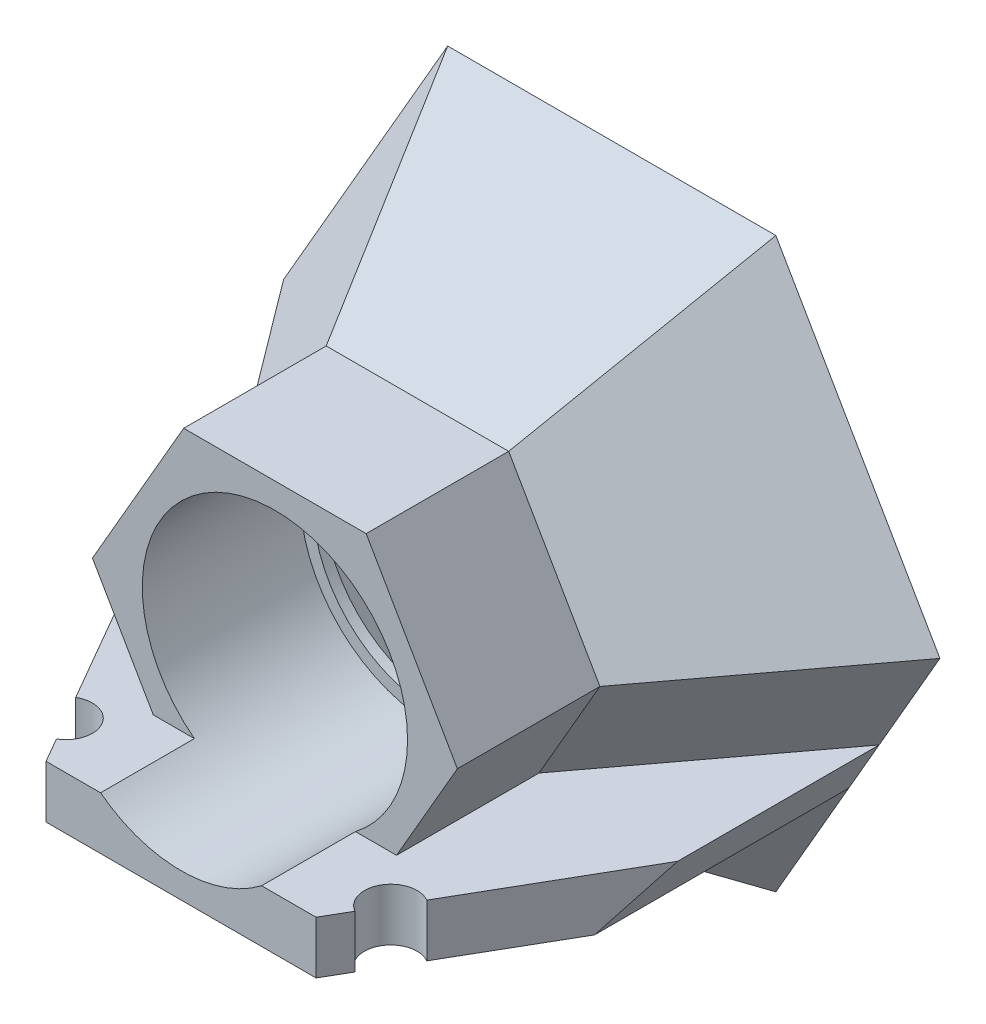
ISO-10303-21;
HEADER;
FILE_DESCRIPTION(('STEP AP214'),'2;1');
FILE_NAME('part.step','',(''),(''),'','','');
FILE_SCHEMA(('AUTOMOTIVE_DESIGN { 1 0 10303 214 1 1 1 1 }'));
ENDSEC;
DATA;
#1=APPLICATION_CONTEXT('core data for automotive mechanical design processes');
#2=APPLICATION_PROTOCOL_DEFINITION('international standard','automotive_design',2000,#1);
#3=PRODUCT_CONTEXT('',#1,'mechanical');
#4=PRODUCT('Part','Part','',(#3));
#5=PRODUCT_RELATED_PRODUCT_CATEGORY('part','',(#4));
#6=PRODUCT_DEFINITION_FORMATION('','',#4);
#7=PRODUCT_DEFINITION_CONTEXT('part definition',#1,'design');
#8=PRODUCT_DEFINITION('design','',#6,#7);
#9=PRODUCT_DEFINITION_SHAPE('','',#8);
#10=(LENGTH_UNIT() NAMED_UNIT(*) SI_UNIT(.MILLI.,.METRE.));
#11=(NAMED_UNIT(*) PLANE_ANGLE_UNIT() SI_UNIT($,.RADIAN.));
#12=(NAMED_UNIT(*) SI_UNIT($,.STERADIAN.) SOLID_ANGLE_UNIT());
#13=UNCERTAINTY_MEASURE_WITH_UNIT(LENGTH_MEASURE(1.E-05),#10,'distance_accuracy_value','');
#14=(GEOMETRIC_REPRESENTATION_CONTEXT(3) GLOBAL_UNCERTAINTY_ASSIGNED_CONTEXT((#13)) GLOBAL_UNIT_ASSIGNED_CONTEXT((#10,
#11,#12)) REPRESENTATION_CONTEXT('',''));
#15=CARTESIAN_POINT('',(0.,0.,0.));
#16=DIRECTION('',(0.,0.,1.));
#17=DIRECTION('',(1.,0.,0.));
#18=AXIS2_PLACEMENT_3D('',#15,#16,#17);
#19=CARTESIAN_POINT('',(-12.6982856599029,-15.0059240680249,9.57143399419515));
#20=DIRECTION('',(0.866025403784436,0.,-0.500000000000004));
#21=DIRECTION('',(-0.500000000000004,0.,-0.866025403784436));
#22=AXIS2_PLACEMENT_3D('',#19,#20,#21);
#23=PLANE('',#22);
#24=DIRECTION('',(-0.500000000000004,0.,-0.866025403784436));
#25=VECTOR('',#24,1.);
#26=CARTESIAN_POINT('',(-12.6982856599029,-5.00592406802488,9.57143399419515));
#27=LINE('',#26,#25);
#28=CARTESIAN_POINT('',(-8.33733836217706,-5.00592406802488,17.1248162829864));
#29=VERTEX_POINT('',#28);
#30=CARTESIAN_POINT('',(-12.6982856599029,-5.00592406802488,9.57143399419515));
#31=VERTEX_POINT('',#30);
#32=EDGE_CURVE('E488',#29,#31,#27,.T.);
#33=ORIENTED_EDGE('',*,*,#32,.T.);
#34=DIRECTION('',(0.377964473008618,-0.654653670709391,0.654653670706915));
#35=VECTOR('',#34,1.);
#36=CARTESIAN_POINT('',(-10.2239273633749,-9.29163835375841,13.8571482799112));
#37=LINE('',#36,#35);
#38=CARTESIAN_POINT('',(-11.254909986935,-7.50592406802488,12.0714339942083));
#39=VERTEX_POINT('',#38);
#40=EDGE_CURVE('E270',#31,#39,#37,.T.);
#41=ORIENTED_EDGE('',*,*,#40,.T.);
#42=DIRECTION('',(0.500000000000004,0.,0.866025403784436));
#43=VECTOR('',#42,1.);
#44=CARTESIAN_POINT('',(-216521.102599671,-7.50592406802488,-374993.985103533));
#45=LINE('',#44,#43);
#46=CARTESIAN_POINT('',(-8.33733836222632,-7.50592406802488,17.1248162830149));
#47=VERTEX_POINT('',#46);
#48=EDGE_CURVE('E487',#39,#47,#45,.T.);
#49=ORIENTED_EDGE('',*,*,#48,.T.);
#50=DIRECTION('',(0.,1.,0.));
#51=VECTOR('',#50,1.);
#52=CARTESIAN_POINT('',(-8.33733836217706,-15.0059240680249,17.1248162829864));
#53=LINE('',#52,#51);
#54=EDGE_CURVE('E12',#47,#29,#53,.T.);
#55=ORIENTED_EDGE('',*,*,#54,.T.);
#56=EDGE_LOOP('',(#33,#41,#49,#55));
#57=FACE_BOUND('',#56,.T.);
#58=ADVANCED_FACE('F47',(#57),#23,.F.);
#59=CARTESIAN_POINT('',(12.6982856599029,-15.0059240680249,9.57143399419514));
#60=DIRECTION('',(-0.866025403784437,0.,-0.500000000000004));
#61=DIRECTION('',(-0.500000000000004,0.,0.866025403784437));
#62=AXIS2_PLACEMENT_3D('',#59,#60,#61);
#63=PLANE('',#62);
#64=DIRECTION('',(0.500000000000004,0.,-0.866025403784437));
#65=VECTOR('',#64,1.);
#66=CARTESIAN_POINT('',(216518.93582603,-7.50592406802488,-374990.2321415));
#67=LINE('',#66,#65);
#68=CARTESIAN_POINT('',(6.41330025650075,-7.50592406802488,20.4573480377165));
#69=VERTEX_POINT('',#68);
#70=CARTESIAN_POINT('',(7.08733836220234,-7.50592406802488,19.2898797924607));
#71=VERTEX_POINT('',#70);
#72=EDGE_CURVE('E274',#69,#71,#67,.T.);
#73=ORIENTED_EDGE('',*,*,#72,.T.);
#74=DIRECTION('',(0.,1.,0.));
#75=VECTOR('',#74,1.);
#76=CARTESIAN_POINT('',(7.08733836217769,-15.0059240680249,19.2898797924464));
#77=LINE('',#76,#75);
#78=CARTESIAN_POINT('',(7.08733836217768,-5.00592406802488,19.2898797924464));
#79=VERTEX_POINT('',#78);
#80=EDGE_CURVE('E472',#71,#79,#77,.T.);
#81=ORIENTED_EDGE('',*,*,#80,.T.);
#82=DIRECTION('',(-0.500000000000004,0.,0.866025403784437));
#83=VECTOR('',#82,1.);
#84=CARTESIAN_POINT('',(12.6982856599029,-5.00592406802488,9.57143399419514));
#85=LINE('',#84,#83);
#86=CARTESIAN_POINT('',(6.41330025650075,-5.00592406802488,20.4573480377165));
#87=VERTEX_POINT('',#86);
#88=EDGE_CURVE('E279',#79,#87,#85,.T.);
#89=ORIENTED_EDGE('',*,*,#88,.T.);
#90=DIRECTION('',(0.,1.,0.));
#91=VECTOR('',#90,1.);
#92=CARTESIAN_POINT('',(6.41330025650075,-15.0059240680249,20.4573480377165));
#93=LINE('',#92,#91);
#94=EDGE_CURVE('E495',#69,#87,#93,.T.);
#95=ORIENTED_EDGE('',*,*,#94,.F.);
#96=EDGE_LOOP('',(#73,#81,#89,#95));
#97=FACE_BOUND('',#96,.T.);
#98=ADVANCED_FACE('F550',(#97),#63,.F.);
#99=CARTESIAN_POINT('',(11.2549099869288,-7.50592406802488,-500000.));
#100=DIRECTION('',(0.866025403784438,-0.500000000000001,0.));
#101=DIRECTION('',(0.500000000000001,0.866025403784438,0.));
#102=AXIS2_PLACEMENT_3D('',#99,#100,#101);
#103=PLANE('',#102);
#104=DIRECTION('',(0.,0.,1.));
#105=VECTOR('',#104,1.);
#106=CARTESIAN_POINT('',(12.6982856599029,-5.00592406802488,-500000.));
#107=LINE('',#106,#105);
#108=CARTESIAN_POINT('',(12.6982856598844,-5.00592406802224,1.70530256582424E-10));
#109=VERTEX_POINT('',#108);
#110=CARTESIAN_POINT('',(12.6982856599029,-5.00592406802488,9.57143399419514));
#111=VERTEX_POINT('',#110);
#112=EDGE_CURVE('E261',#109,#111,#107,.T.);
#113=ORIENTED_EDGE('',*,*,#112,.T.);
#114=DIRECTION('',(0.377964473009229,0.65465367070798,-0.654653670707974));
#115=VECTOR('',#114,1.);
#116=CARTESIAN_POINT('',(10.2239273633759,-9.2916383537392,13.8571482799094));
#117=LINE('',#116,#115);
#118=CARTESIAN_POINT('',(11.2549099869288,-7.50592406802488,12.0714339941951));
#119=VERTEX_POINT('',#118);
#120=EDGE_CURVE('E264',#119,#111,#117,.T.);
#121=ORIENTED_EDGE('',*,*,#120,.F.);
#122=DIRECTION('',(0.,0.,1.));
#123=VECTOR('',#122,1.);
#124=CARTESIAN_POINT('',(11.2549099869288,-7.50592406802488,-500000.));
#125=LINE('',#124,#123);
#126=CARTESIAN_POINT('',(11.2549099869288,-7.50592406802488,5.6843418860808E-11));
#127=VERTEX_POINT('',#126);
#128=EDGE_CURVE('E251',#127,#119,#125,.T.);
#129=ORIENTED_EDGE('',*,*,#128,.F.);
#130=DIRECTION('',(-0.500000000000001,-0.866025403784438,0.));
#131=VECTOR('',#130,1.);
#132=CARTESIAN_POINT('',(11.2549099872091,-7.50592406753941,5.6843418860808E-11));
#133=LINE('',#132,#131);
#134=EDGE_CURVE('E308',#127,#109,#133,.F.);
#135=ORIENTED_EDGE('',*,*,#134,.T.);
#136=EDGE_LOOP('',(#113,#121,#129,#135));
#137=FACE_BOUND('',#136,.T.);
#138=ADVANCED_FACE('F265',(#137),#103,.T.);
#139=CARTESIAN_POINT('',(-11.2549099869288,-7.50592406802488,-500000.));
#140=DIRECTION('',(-0.866025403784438,-0.500000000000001,0.));
#141=DIRECTION('',(0.500000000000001,-0.866025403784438,0.));
#142=AXIS2_PLACEMENT_3D('',#139,#140,#141);
#143=PLANE('',#142);
#144=DIRECTION('',(0.,0.,1.));
#145=VECTOR('',#144,1.);
#146=CARTESIAN_POINT('',(-11.2549099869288,-7.50592406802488,-500000.));
#147=LINE('',#146,#145);
#148=CARTESIAN_POINT('',(-11.2549099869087,-7.50592406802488,5.6843418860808E-11));
#149=VERTEX_POINT('',#148);
#150=EDGE_CURVE('E301',#149,#39,#147,.T.);
#151=ORIENTED_EDGE('',*,*,#150,.T.);
#152=ORIENTED_EDGE('',*,*,#40,.F.);
#153=DIRECTION('',(0.,0.,1.));
#154=VECTOR('',#153,1.);
#155=CARTESIAN_POINT('',(-12.6982856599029,-5.00592406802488,-500000.));
#156=LINE('',#155,#154);
#157=CARTESIAN_POINT('',(-12.6982856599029,-5.00592406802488,5.6843418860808E-11));
#158=VERTEX_POINT('',#157);
#159=EDGE_CURVE('E296',#158,#31,#156,.T.);
#160=ORIENTED_EDGE('',*,*,#159,.F.);
#161=DIRECTION('',(-0.500000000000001,0.866025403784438,0.));
#162=VECTOR('',#161,1.);
#163=CARTESIAN_POINT('',(-11.2549099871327,-7.50592406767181,5.6843418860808E-11));
#164=LINE('',#163,#162);
#165=EDGE_CURVE('E295',#158,#149,#164,.F.);
#166=ORIENTED_EDGE('',*,*,#165,.T.);
#167=EDGE_LOOP('',(#151,#152,#160,#166));
#168=FACE_BOUND('',#167,.T.);
#169=ADVANCED_FACE('F578',(#168),#143,.T.);
#170=CARTESIAN_POINT('',(-15.5884572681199,0.,0.));
#171=DIRECTION('',(-0.72631001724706,-0.419335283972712,0.544639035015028));
#172=DIRECTION('',(0.599934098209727,0.,0.800049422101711));
#173=AXIS2_PLACEMENT_3D('',#170,#171,#172);
#174=PLANE('',#173);
#175=DIRECTION('',(-0.299967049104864,-0.519558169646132,-0.800049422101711));
#176=VECTOR('',#175,1.);
#177=CARTESIAN_POINT('',(-7.79422863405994,-13.5,0.));
#178=LINE('',#177,#176);
#179=CARTESIAN_POINT('',(-4.33354728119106,-7.50592406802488,9.23006751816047));
#180=VERTEX_POINT('',#179);
#181=CARTESIAN_POINT('',(-7.79422863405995,-13.5,0.));
#182=VERTEX_POINT('',#181);
#183=EDGE_CURVE('E437',#180,#182,#178,.T.);
#184=ORIENTED_EDGE('',*,*,#183,.F.);
#185=DIRECTION('',(-0.599934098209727,0.,-0.800049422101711));
#186=VECTOR('',#185,1.);
#187=CARTESIAN_POINT('',(-239997.228052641,-7.50592406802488,-320036.216808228));
#188=LINE('',#187,#186);
#189=EDGE_CURVE('E293',#149,#180,#188,.F.);
#190=ORIENTED_EDGE('',*,*,#189,.F.);
#191=DIRECTION('',(0.5,-0.866025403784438,0.));
#192=VECTOR('',#191,1.);
#193=CARTESIAN_POINT('',(-15.5884572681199,0.,0.));
#194=LINE('',#193,#192);
#195=EDGE_CURVE('E417',#149,#182,#194,.T.);
#196=ORIENTED_EDGE('',*,*,#195,.T.);
#197=EDGE_LOOP('',(#184,#190,#196));
#198=FACE_BOUND('',#197,.T.);
#199=ADVANCED_FACE('F520',(#198),#174,.T.);
#200=CARTESIAN_POINT('',(7.79422863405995,-13.5,0.));
#201=DIRECTION('',(0.72631001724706,-0.419335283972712,0.544639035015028));
#202=DIRECTION('',(0.599934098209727,0.,-0.800049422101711));
#203=AXIS2_PLACEMENT_3D('',#200,#201,#202);
#204=PLANE('',#203);
#205=DIRECTION('',(-0.5,-0.866025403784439,0.));
#206=VECTOR('',#205,1.);
#207=CARTESIAN_POINT('',(4.33354728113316,-7.50592406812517,9.23006751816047));
#208=LINE('',#207,#206);
#209=CARTESIAN_POINT('',(5.77692295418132,-5.00592406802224,9.23006751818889));
#210=VERTEX_POINT('',#209);
#211=CARTESIAN_POINT('',(8.66709456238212,0.,9.23006751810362));
#212=VERTEX_POINT('',#211);
#213=EDGE_CURVE('E347',#210,#212,#208,.F.);
#214=ORIENTED_EDGE('',*,*,#213,.F.);
#215=DIRECTION('',(0.599934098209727,0.,-0.800049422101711));
#216=VECTOR('',#215,1.);
#217=CARTESIAN_POINT('',(240001.162571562,-5.0059240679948,-320039.538902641));
#218=LINE('',#217,#216);
#219=EDGE_CURVE('E260',#109,#210,#218,.F.);
#220=ORIENTED_EDGE('',*,*,#219,.F.);
#221=DIRECTION('',(0.5,0.866025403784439,0.));
#222=VECTOR('',#221,1.);
#223=CARTESIAN_POINT('',(7.79422863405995,-13.5,0.));
#224=LINE('',#223,#222);
#225=CARTESIAN_POINT('',(15.5884572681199,0.,0.));
#226=VERTEX_POINT('',#225);
#227=EDGE_CURVE('E424',#109,#226,#224,.T.);
#228=ORIENTED_EDGE('',*,*,#227,.T.);
#229=DIRECTION('',(0.599934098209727,0.,-0.800049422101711));
#230=VECTOR('',#229,1.);
#231=CARTESIAN_POINT('',(15.5884572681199,0.,0.));
#232=LINE('',#231,#230);
#233=EDGE_CURVE('E428',#212,#226,#232,.T.);
#234=ORIENTED_EDGE('',*,*,#233,.F.);
#235=EDGE_LOOP('',(#214,#220,#228,#234));
#236=FACE_BOUND('',#235,.T.);
#237=ADVANCED_FACE('F535',(#236),#204,.T.);
#238=CARTESIAN_POINT('',(15.5884572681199,0.,0.));
#239=DIRECTION('',(0.72631001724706,0.419335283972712,0.544639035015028));
#240=DIRECTION('',(0.599934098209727,0.,-0.800049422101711));
#241=AXIS2_PLACEMENT_3D('',#238,#239,#240);
#242=PLANE('',#241);
#243=DIRECTION('',(0.299967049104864,0.519558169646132,-0.800049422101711));
#244=VECTOR('',#243,1.);
#245=CARTESIAN_POINT('',(7.79422863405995,13.5,0.));
#246=LINE('',#245,#244);
#247=CARTESIAN_POINT('',(4.33354728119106,7.50592406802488,9.23006751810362));
#248=VERTEX_POINT('',#247);
#249=CARTESIAN_POINT('',(7.79422863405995,13.5,0.));
#250=VERTEX_POINT('',#249);
#251=EDGE_CURVE('E429',#248,#250,#246,.T.);
#252=ORIENTED_EDGE('',*,*,#251,.F.);
#253=DIRECTION('',(0.5,-0.866025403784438,0.));
#254=VECTOR('',#253,1.);
#255=CARTESIAN_POINT('',(8.66709456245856,-1.32398094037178E-10,9.23006751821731));
#256=LINE('',#255,#254);
#257=EDGE_CURVE('E350',#212,#248,#256,.F.);
#258=ORIENTED_EDGE('',*,*,#257,.F.);
#259=ORIENTED_EDGE('',*,*,#233,.T.);
#260=DIRECTION('',(-0.5,0.866025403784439,0.));
#261=VECTOR('',#260,1.);
#262=CARTESIAN_POINT('',(15.5884572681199,0.,0.));
#263=LINE('',#262,#261);
#264=EDGE_CURVE('E381',#226,#250,#263,.T.);
#265=ORIENTED_EDGE('',*,*,#264,.T.);
#266=EDGE_LOOP('',(#252,#258,#259,#265));
#267=FACE_BOUND('',#266,.T.);
#268=ADVANCED_FACE('F547',(#267),#242,.T.);
#269=CARTESIAN_POINT('',(7.79422863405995,13.5,0.));
#270=DIRECTION('',(0.,0.838670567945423,0.544639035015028));
#271=DIRECTION('',(0.,-0.544639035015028,0.838670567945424));
#272=AXIS2_PLACEMENT_3D('',#269,#270,#271);
#273=PLANE('',#272);
#274=DIRECTION('',(-0.299967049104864,0.519558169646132,-0.800049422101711));
#275=VECTOR('',#274,1.);
#276=CARTESIAN_POINT('',(-7.79422863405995,13.5,0.));
#277=LINE('',#276,#275);
#278=CARTESIAN_POINT('',(-4.33354728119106,7.50592406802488,9.23006751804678));
#279=VERTEX_POINT('',#278);
#280=CARTESIAN_POINT('',(-7.79422863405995,13.5,0.));
#281=VERTEX_POINT('',#280);
#282=EDGE_CURVE('E432',#279,#281,#277,.T.);
#283=ORIENTED_EDGE('',*,*,#282,.F.);
#284=DIRECTION('',(1.,0.,0.));
#285=VECTOR('',#284,1.);
#286=CARTESIAN_POINT('',(4.33354728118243,7.50592406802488,9.23006751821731));
#287=LINE('',#286,#285);
#288=EDGE_CURVE('E359',#248,#279,#287,.F.);
#289=ORIENTED_EDGE('',*,*,#288,.F.);
#290=ORIENTED_EDGE('',*,*,#251,.T.);
#291=DIRECTION('',(-1.,0.,0.));
#292=VECTOR('',#291,1.);
#293=CARTESIAN_POINT('',(7.79422863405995,13.5,0.));
#294=LINE('',#293,#292);
#295=EDGE_CURVE('E411',#250,#281,#294,.T.);
#296=ORIENTED_EDGE('',*,*,#295,.T.);
#297=EDGE_LOOP('',(#283,#289,#290,#296));
#298=FACE_BOUND('',#297,.T.);
#299=ADVANCED_FACE('F49',(#298),#273,.T.);
#300=CARTESIAN_POINT('',(-7.79422863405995,13.5,0.));
#301=DIRECTION('',(-0.72631001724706,0.419335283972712,0.544639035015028));
#302=DIRECTION('',(0.599934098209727,0.,0.800049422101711));
#303=AXIS2_PLACEMENT_3D('',#300,#301,#302);
#304=PLANE('',#303);
#305=DIRECTION('',(-0.599934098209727,0.,-0.800049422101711));
#306=VECTOR('',#305,1.);
#307=CARTESIAN_POINT('',(-15.5884572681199,0.,0.));
#308=LINE('',#307,#306);
#309=CARTESIAN_POINT('',(-8.66709456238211,0.,9.23006751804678));
#310=VERTEX_POINT('',#309);
#311=CARTESIAN_POINT('',(-15.5884572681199,0.,0.));
#312=VERTEX_POINT('',#311);
#313=EDGE_CURVE('E440',#310,#312,#308,.T.);
#314=ORIENTED_EDGE('',*,*,#313,.F.);
#315=DIRECTION('',(0.5,0.866025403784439,0.));
#316=VECTOR('',#315,1.);
#317=CARTESIAN_POINT('',(-4.33354728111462,7.50592406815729,9.23006751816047));
#318=LINE('',#317,#316);
#319=EDGE_CURVE('E357',#279,#310,#318,.F.);
#320=ORIENTED_EDGE('',*,*,#319,.F.);
#321=ORIENTED_EDGE('',*,*,#282,.T.);
#322=DIRECTION('',(-0.5,-0.866025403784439,0.));
#323=VECTOR('',#322,1.);
#324=CARTESIAN_POINT('',(-7.79422863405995,13.5,0.));
#325=LINE('',#324,#323);
#326=EDGE_CURVE('E414',#281,#312,#325,.T.);
#327=ORIENTED_EDGE('',*,*,#326,.T.);
#328=EDGE_LOOP('',(#314,#320,#321,#327));
#329=FACE_BOUND('',#328,.T.);
#330=ADVANCED_FACE('F677',(#329),#304,.T.);
#331=EDGE_CURVE('E418',#312,#158,#194,.T.);
#332=ORIENTED_EDGE('',*,*,#331,.T.);
#333=DIRECTION('',(0.599934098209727,0.,0.800049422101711));
#334=VECTOR('',#333,1.);
#335=CARTESIAN_POINT('',(-240001.162571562,-5.0059240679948,-320039.538902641));
#336=LINE('',#335,#334);
#337=CARTESIAN_POINT('',(-5.77692295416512,-5.00592406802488,9.23006751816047));
#338=VERTEX_POINT('',#337);
#339=EDGE_CURVE('E297',#338,#158,#336,.F.);
#340=ORIENTED_EDGE('',*,*,#339,.F.);
#341=DIRECTION('',(-0.5,0.866025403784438,0.));
#342=VECTOR('',#341,1.);
#343=CARTESIAN_POINT('',(-8.66709456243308,8.82728235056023E-11,9.23006751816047));
#344=LINE('',#343,#342);
#345=EDGE_CURVE('E353',#310,#338,#344,.F.);
#346=ORIENTED_EDGE('',*,*,#345,.F.);
#347=ORIENTED_EDGE('',*,*,#313,.T.);
#348=EDGE_LOOP('',(#332,#340,#346,#347));
#349=FACE_BOUND('',#348,.T.);
#350=ADVANCED_FACE('F543',(#349),#174,.T.);
#351=CARTESIAN_POINT('',(-7.79422863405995,-13.5,0.));
#352=DIRECTION('',(0.,-0.838670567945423,0.544639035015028));
#353=DIRECTION('',(0.,-0.544639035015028,-0.838670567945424));
#354=AXIS2_PLACEMENT_3D('',#351,#352,#353);
#355=PLANE('',#354);
#356=DIRECTION('',(0.299967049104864,-0.519558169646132,-0.800049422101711));
#357=VECTOR('',#356,1.);
#358=CARTESIAN_POINT('',(7.79422863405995,-13.5,0.));
#359=LINE('',#358,#357);
#360=CARTESIAN_POINT('',(4.33354728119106,-7.50592406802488,9.23006751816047));
#361=VERTEX_POINT('',#360);
#362=CARTESIAN_POINT('',(7.79422863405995,-13.5,0.));
#363=VERTEX_POINT('',#362);
#364=EDGE_CURVE('E435',#361,#363,#359,.T.);
#365=ORIENTED_EDGE('',*,*,#364,.F.);
#366=DIRECTION('',(-1.,0.,0.));
#367=VECTOR('',#366,1.);
#368=CARTESIAN_POINT('',(-4.33354728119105,-7.50592406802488,9.23006751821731));
#369=LINE('',#368,#367);
#370=EDGE_CURVE('E351',#180,#361,#369,.F.);
#371=ORIENTED_EDGE('',*,*,#370,.F.);
#372=ORIENTED_EDGE('',*,*,#183,.T.);
#373=DIRECTION('',(1.,0.,0.));
#374=VECTOR('',#373,1.);
#375=CARTESIAN_POINT('',(-7.79422863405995,-13.5,0.));
#376=LINE('',#375,#374);
#377=EDGE_CURVE('E421',#182,#363,#376,.T.);
#378=ORIENTED_EDGE('',*,*,#377,.T.);
#379=EDGE_LOOP('',(#365,#371,#372,#378));
#380=FACE_BOUND('',#379,.T.);
#381=ADVANCED_FACE('F530',(#380),#355,.T.);
#382=EDGE_CURVE('E425',#363,#127,#224,.T.);
#383=ORIENTED_EDGE('',*,*,#382,.T.);
#384=DIRECTION('',(-0.599934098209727,0.,0.800049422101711));
#385=VECTOR('',#384,1.);
#386=CARTESIAN_POINT('',(239997.228052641,-7.50592406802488,-320036.216808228));
#387=LINE('',#386,#385);
#388=EDGE_CURVE('E257',#361,#127,#387,.F.);
#389=ORIENTED_EDGE('',*,*,#388,.F.);
#390=ORIENTED_EDGE('',*,*,#364,.T.);
#391=EDGE_LOOP('',(#383,#389,#390));
#392=FACE_BOUND('',#391,.T.);
#393=ADVANCED_FACE('F532',(#392),#204,.T.);
#394=CARTESIAN_POINT('',(0.,27.,0.));
#395=DIRECTION('',(0.,0.,1.));
#396=DIRECTION('',(1.,0.,0.));
#397=AXIS2_PLACEMENT_3D('',#394,#395,#396);
#398=PLANE('',#397);
#399=DIRECTION('',(-1.,0.,0.));
#400=VECTOR('',#399,1.);
#401=CARTESIAN_POINT('',(6.41740609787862,-12.4726626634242,0.));
#402=LINE('',#401,#400);
#403=CARTESIAN_POINT('',(-7.20109514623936,-12.4726626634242,0.));
#404=VERTEX_POINT('',#403);
#405=CARTESIAN_POINT('',(7.20109514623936,-12.4726626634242,0.));
#406=VERTEX_POINT('',#405);
#407=EDGE_CURVE('E450',#404,#406,#402,.F.);
#408=ORIENTED_EDGE('',*,*,#407,.T.);
#409=DIRECTION('',(-0.5,-0.866025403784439,0.));
#410=VECTOR('',#409,1.);
#411=CARTESIAN_POINT('',(14.0103457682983,-0.678694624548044,0.));
#412=LINE('',#411,#410);
#413=CARTESIAN_POINT('',(14.4021902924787,0.,0.));
#414=VERTEX_POINT('',#413);
#415=EDGE_CURVE('E452',#406,#414,#412,.F.);
#416=ORIENTED_EDGE('',*,*,#415,.T.);
#417=DIRECTION('',(0.5,-0.866025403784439,0.));
#418=VECTOR('',#417,1.);
#419=CARTESIAN_POINT('',(7.59293967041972,11.7939680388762,0.));
#420=LINE('',#419,#418);
#421=CARTESIAN_POINT('',(7.20109514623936,12.4726626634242,0.));
#422=VERTEX_POINT('',#421);
#423=EDGE_CURVE('E431',#414,#422,#420,.F.);
#424=ORIENTED_EDGE('',*,*,#423,.T.);
#425=DIRECTION('',(1.,0.,0.));
#426=VECTOR('',#425,1.);
#427=CARTESIAN_POINT('',(-6.41740609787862,12.4726626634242,0.));
#428=LINE('',#427,#426);
#429=CARTESIAN_POINT('',(-7.20109514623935,12.4726626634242,0.));
#430=VERTEX_POINT('',#429);
#431=EDGE_CURVE('E444',#422,#430,#428,.F.);
#432=ORIENTED_EDGE('',*,*,#431,.T.);
#433=DIRECTION('',(0.5,0.866025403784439,0.));
#434=VECTOR('',#433,1.);
#435=CARTESIAN_POINT('',(-14.0103457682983,0.678694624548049,0.));
#436=LINE('',#435,#434);
#437=CARTESIAN_POINT('',(-14.4021902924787,0.,0.));
#438=VERTEX_POINT('',#437);
#439=EDGE_CURVE('E446',#430,#438,#436,.F.);
#440=ORIENTED_EDGE('',*,*,#439,.T.);
#441=DIRECTION('',(-0.5,0.866025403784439,0.));
#442=VECTOR('',#441,1.);
#443=CARTESIAN_POINT('',(-7.59293967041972,-11.7939680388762,0.));
#444=LINE('',#443,#442);
#445=EDGE_CURVE('E448',#438,#404,#444,.F.);
#446=ORIENTED_EDGE('',*,*,#445,.T.);
#447=EDGE_LOOP('',(#408,#416,#424,#432,#440,#446));
#448=FACE_BOUND('',#447,.T.);
#449=ORIENTED_EDGE('',*,*,#264,.F.);
#450=ORIENTED_EDGE('',*,*,#227,.F.);
#451=ORIENTED_EDGE('',*,*,#134,.F.);
#452=ORIENTED_EDGE('',*,*,#382,.F.);
#453=ORIENTED_EDGE('',*,*,#377,.F.);
#454=ORIENTED_EDGE('',*,*,#195,.F.);
#455=ORIENTED_EDGE('',*,*,#165,.F.);
#456=ORIENTED_EDGE('',*,*,#331,.F.);
#457=ORIENTED_EDGE('',*,*,#326,.F.);
#458=ORIENTED_EDGE('',*,*,#295,.F.);
#459=EDGE_LOOP('',(#449,#450,#451,#452,#453,#454,#455,#456,#457,#458));
#460=FACE_BOUND('',#459,.T.);
#461=ADVANCED_FACE('F525',(#448,#460),#398,.F.);
#462=CARTESIAN_POINT('',(14.1358372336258,-0.838670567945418,-1.08927807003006));
#463=DIRECTION('',(0.72631001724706,0.419335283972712,0.544639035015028));
#464=DIRECTION('',(0.599934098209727,0.,-0.800049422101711));
#465=AXIS2_PLACEMENT_3D('',#462,#463,#464);
#466=PLANE('',#465);
#467=DIRECTION('',(0.299967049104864,0.519558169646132,-0.800049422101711));
#468=VECTOR('',#467,1.);
#469=CARTESIAN_POINT('',(6.91295333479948,11.9735864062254,-1.32168610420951));
#470=LINE('',#469,#468);
#471=CARTESIAN_POINT('',(3.41792090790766,5.92001266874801,8.));
#472=VERTEX_POINT('',#471);
#473=CARTESIAN_POINT('',(5.99057845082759,10.3759862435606,1.13840241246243));
#474=VERTEX_POINT('',#473);
#475=EDGE_CURVE('E378',#472,#474,#470,.T.);
#476=ORIENTED_EDGE('',*,*,#475,.T.);
#477=DIRECTION('',(-0.5,0.866025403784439,0.));
#478=VECTOR('',#477,1.);
#479=CARTESIAN_POINT('',(12.1945707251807,-0.369643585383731,1.13840241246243));
#480=LINE('',#479,#478);
#481=CARTESIAN_POINT('',(11.9811569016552,0.,1.13840241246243));
#482=VERTEX_POINT('',#481);
#483=EDGE_CURVE('E466',#474,#482,#480,.F.);
#484=ORIENTED_EDGE('',*,*,#483,.T.);
#485=DIRECTION('',(0.599934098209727,0.,-0.800049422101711));
#486=VECTOR('',#485,1.);
#487=CARTESIAN_POINT('',(13.825906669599,0.,-1.32168610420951));
#488=LINE('',#487,#486);
#489=CARTESIAN_POINT('',(6.83584181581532,0.,8.));
#490=VERTEX_POINT('',#489);
#491=EDGE_CURVE('E386',#490,#482,#488,.T.);
#492=ORIENTED_EDGE('',*,*,#491,.F.);
#493=DIRECTION('',(0.5,-0.866025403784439,0.));
#494=VECTOR('',#493,1.);
#495=CARTESIAN_POINT('',(9.02399567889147,-3.78999366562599,8.));
#496=LINE('',#495,#494);
#497=EDGE_CURVE('E377',#490,#472,#496,.F.);
#498=ORIENTED_EDGE('',*,*,#497,.T.);
#499=EDGE_LOOP('',(#476,#484,#492,#498));
#500=FACE_BOUND('',#499,.T.);
#501=ADVANCED_FACE('F540',(#500),#466,.F.);
#502=CARTESIAN_POINT('',(7.79422863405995,11.8226588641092,-1.08927807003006));
#503=DIRECTION('',(0.,0.838670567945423,0.544639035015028));
#504=DIRECTION('',(0.,-0.544639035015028,0.838670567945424));
#505=AXIS2_PLACEMENT_3D('',#502,#503,#504);
#506=PLANE('',#505);
#507=DIRECTION('',(-0.299967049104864,0.519558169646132,-0.800049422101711));
#508=VECTOR('',#507,1.);
#509=CARTESIAN_POINT('',(-6.91295333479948,11.9735864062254,-1.32168610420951));
#510=LINE('',#509,#508);
#511=CARTESIAN_POINT('',(-3.41792090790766,5.92001266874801,8.));
#512=VERTEX_POINT('',#511);
#513=CARTESIAN_POINT('',(-5.99057845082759,10.3759862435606,1.13840241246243));
#514=VERTEX_POINT('',#513);
#515=EDGE_CURVE('E382',#512,#514,#510,.T.);
#516=ORIENTED_EDGE('',*,*,#515,.T.);
#517=DIRECTION('',(-1.,0.,0.));
#518=VECTOR('',#517,1.);
#519=CARTESIAN_POINT('',(6.41740609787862,10.3759862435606,1.13840241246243));
#520=LINE('',#519,#518);
#521=EDGE_CURVE('E464',#514,#474,#520,.F.);
#522=ORIENTED_EDGE('',*,*,#521,.T.);
#523=ORIENTED_EDGE('',*,*,#475,.F.);
#524=DIRECTION('',(1.,0.,0.));
#525=VECTOR('',#524,1.);
#526=CARTESIAN_POINT('',(7.79422863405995,5.92001266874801,8.));
#527=LINE('',#526,#525);
#528=EDGE_CURVE('E385',#472,#512,#527,.F.);
#529=ORIENTED_EDGE('',*,*,#528,.T.);
#530=EDGE_LOOP('',(#516,#522,#523,#529));
#531=FACE_BOUND('',#530,.T.);
#532=ADVANCED_FACE('F649',(#531),#506,.F.);
#533=CARTESIAN_POINT('',(-6.34160859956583,12.6613294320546,-1.08927807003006));
#534=DIRECTION('',(-0.72631001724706,0.419335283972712,0.544639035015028));
#535=DIRECTION('',(0.599934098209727,0.,0.800049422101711));
#536=AXIS2_PLACEMENT_3D('',#533,#534,#535);
#537=PLANE('',#536);
#538=DIRECTION('',(-0.599934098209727,0.,-0.800049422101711));
#539=VECTOR('',#538,1.);
#540=CARTESIAN_POINT('',(-13.825906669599,0.,-1.32168610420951));
#541=LINE('',#540,#539);
#542=CARTESIAN_POINT('',(-6.83584181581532,0.,8.));
#543=VERTEX_POINT('',#542);
#544=CARTESIAN_POINT('',(-11.9811569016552,0.,1.13840241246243));
#545=VERTEX_POINT('',#544);
#546=EDGE_CURVE('E393',#543,#545,#541,.T.);
#547=ORIENTED_EDGE('',*,*,#546,.T.);
#548=DIRECTION('',(-0.5,-0.866025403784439,0.));
#549=VECTOR('',#548,1.);
#550=CARTESIAN_POINT('',(-5.77716462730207,10.7456298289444,1.13840241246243));
#551=LINE('',#550,#549);
#552=EDGE_CURVE('E462',#545,#514,#551,.F.);
#553=ORIENTED_EDGE('',*,*,#552,.T.);
#554=ORIENTED_EDGE('',*,*,#515,.F.);
#555=DIRECTION('',(0.5,0.866025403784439,0.));
#556=VECTOR('',#555,1.);
#557=CARTESIAN_POINT('',(-1.22976704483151,9.71000633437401,8.));
#558=LINE('',#557,#556);
#559=EDGE_CURVE('E395',#512,#543,#558,.F.);
#560=ORIENTED_EDGE('',*,*,#559,.T.);
#561=EDGE_LOOP('',(#547,#553,#554,#560));
#562=FACE_BOUND('',#561,.T.);
#563=ADVANCED_FACE('F653',(#562),#537,.F.);
#564=CARTESIAN_POINT('',(-14.1358372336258,0.838670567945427,-1.08927807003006));
#565=DIRECTION('',(-0.72631001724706,-0.419335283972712,0.544639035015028));
#566=DIRECTION('',(0.599934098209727,0.,0.800049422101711));
#567=AXIS2_PLACEMENT_3D('',#564,#565,#566);
#568=PLANE('',#567);
#569=DIRECTION('',(-0.299967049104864,-0.519558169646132,-0.800049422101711));
#570=VECTOR('',#569,1.);
#571=CARTESIAN_POINT('',(-6.91295333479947,-11.9735864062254,-1.32168610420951));
#572=LINE('',#571,#570);
#573=CARTESIAN_POINT('',(-3.41792090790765,-5.92001266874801,8.));
#574=VERTEX_POINT('',#573);
#575=CARTESIAN_POINT('',(-5.99057845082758,-10.3759862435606,1.13840241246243));
#576=VERTEX_POINT('',#575);
#577=EDGE_CURVE('E398',#574,#576,#572,.T.);
#578=ORIENTED_EDGE('',*,*,#577,.T.);
#579=DIRECTION('',(0.5,-0.866025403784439,0.));
#580=VECTOR('',#579,1.);
#581=CARTESIAN_POINT('',(-12.1945707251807,0.369643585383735,1.13840241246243));
#582=LINE('',#581,#580);
#583=EDGE_CURVE('E460',#576,#545,#582,.F.);
#584=ORIENTED_EDGE('',*,*,#583,.T.);
#585=ORIENTED_EDGE('',*,*,#546,.F.);
#586=DIRECTION('',(-0.5,0.866025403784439,0.));
#587=VECTOR('',#586,1.);
#588=CARTESIAN_POINT('',(-9.02399567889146,3.789993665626,8.));
#589=LINE('',#588,#587);
#590=EDGE_CURVE('E400',#543,#574,#589,.F.);
#591=ORIENTED_EDGE('',*,*,#590,.T.);
#592=EDGE_LOOP('',(#578,#584,#585,#591));
#593=FACE_BOUND('',#592,.T.);
#594=ADVANCED_FACE('F657',(#593),#568,.F.);
#595=CARTESIAN_POINT('',(-7.79422863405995,-11.8226588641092,-1.08927807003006));
#596=DIRECTION('',(0.,-0.838670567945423,0.544639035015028));
#597=DIRECTION('',(0.,-0.544639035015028,-0.838670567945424));
#598=AXIS2_PLACEMENT_3D('',#595,#596,#597);
#599=PLANE('',#598);
#600=DIRECTION('',(0.299967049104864,-0.519558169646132,-0.800049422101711));
#601=VECTOR('',#600,1.);
#602=CARTESIAN_POINT('',(6.91295333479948,-11.9735864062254,-1.32168610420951));
#603=LINE('',#602,#601);
#604=CARTESIAN_POINT('',(3.41792090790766,-5.92001266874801,8.));
#605=VERTEX_POINT('',#604);
#606=CARTESIAN_POINT('',(5.99057845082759,-10.3759862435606,1.13840241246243));
#607=VERTEX_POINT('',#606);
#608=EDGE_CURVE('E389',#605,#607,#603,.T.);
#609=ORIENTED_EDGE('',*,*,#608,.T.);
#610=DIRECTION('',(1.,0.,0.));
#611=VECTOR('',#610,1.);
#612=CARTESIAN_POINT('',(-6.41740609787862,-10.3759862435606,1.13840241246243));
#613=LINE('',#612,#611);
#614=EDGE_CURVE('E458',#607,#576,#613,.F.);
#615=ORIENTED_EDGE('',*,*,#614,.T.);
#616=ORIENTED_EDGE('',*,*,#577,.F.);
#617=DIRECTION('',(-1.,0.,0.));
#618=VECTOR('',#617,1.);
#619=CARTESIAN_POINT('',(-7.79422863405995,-5.92001266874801,8.));
#620=LINE('',#619,#618);
#621=EDGE_CURVE('E404',#574,#605,#620,.F.);
#622=ORIENTED_EDGE('',*,*,#621,.T.);
#623=EDGE_LOOP('',(#609,#615,#616,#622));
#624=FACE_BOUND('',#623,.T.);
#625=ADVANCED_FACE('F661',(#624),#599,.F.);
#626=CARTESIAN_POINT('',(6.34160859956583,-12.6613294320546,-1.08927807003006));
#627=DIRECTION('',(0.72631001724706,-0.419335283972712,0.544639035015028));
#628=DIRECTION('',(0.599934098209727,0.,-0.800049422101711));
#629=AXIS2_PLACEMENT_3D('',#626,#627,#628);
#630=PLANE('',#629);
#631=ORIENTED_EDGE('',*,*,#491,.T.);
#632=DIRECTION('',(0.5,0.866025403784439,0.));
#633=VECTOR('',#632,1.);
#634=CARTESIAN_POINT('',(5.77716462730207,-10.7456298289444,1.13840241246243));
#635=LINE('',#634,#633);
#636=EDGE_CURVE('E455',#482,#607,#635,.F.);
#637=ORIENTED_EDGE('',*,*,#636,.T.);
#638=ORIENTED_EDGE('',*,*,#608,.F.);
#639=DIRECTION('',(-0.5,-0.866025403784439,0.));
#640=VECTOR('',#639,1.);
#641=CARTESIAN_POINT('',(1.22976704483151,-9.710006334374,8.));
#642=LINE('',#641,#640);
#643=EDGE_CURVE('E390',#605,#490,#642,.F.);
#644=ORIENTED_EDGE('',*,*,#643,.T.);
#645=EDGE_LOOP('',(#631,#637,#638,#644));
#646=FACE_BOUND('',#645,.T.);
#647=ADVANCED_FACE('F665',(#646),#630,.F.);
#648=CARTESIAN_POINT('',(0.,27.,8.));
#649=DIRECTION('',(0.,0.,1.));
#650=DIRECTION('',(1.,0.,0.));
#651=AXIS2_PLACEMENT_3D('',#648,#649,#650);
#652=PLANE('',#651);
#653=CARTESIAN_POINT('',(0.,0.,8.));
#654=DIRECTION('',(0.,0.,1.));
#655=DIRECTION('',(1.,0.,0.));
#656=AXIS2_PLACEMENT_3D('',#653,#654,#655);
#657=CIRCLE('',#656,5.7);
#658=CARTESIAN_POINT('',(5.7,0.,8.));
#659=VERTEX_POINT('',#658);
#660=EDGE_CURVE('E371',#659,#659,#657,.T.);
#661=ORIENTED_EDGE('',*,*,#660,.T.);
#662=EDGE_LOOP('',(#661));
#663=FACE_BOUND('',#662,.T.);
#664=ORIENTED_EDGE('',*,*,#497,.F.);
#665=ORIENTED_EDGE('',*,*,#643,.F.);
#666=ORIENTED_EDGE('',*,*,#621,.F.);
#667=ORIENTED_EDGE('',*,*,#590,.F.);
#668=ORIENTED_EDGE('',*,*,#559,.F.);
#669=ORIENTED_EDGE('',*,*,#528,.F.);
#670=EDGE_LOOP('',(#664,#665,#666,#667,#668,#669));
#671=FACE_BOUND('',#670,.T.);
#672=ADVANCED_FACE('F645',(#663,#671),#652,.F.);
#673=CARTESIAN_POINT('',(0.,0.,8.5));
#674=DIRECTION('',(0.,0.,1.));
#675=DIRECTION('',(1.,0.,0.));
#676=AXIS2_PLACEMENT_3D('',#673,#674,#675);
#677=CYLINDRICAL_SURFACE('',#676,6.3);
#678=DIRECTION('',(0.,0.,1.));
#679=VECTOR('',#678,1.);
#680=CARTESIAN_POINT('',(-3.82501297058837,-5.00592406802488,9.23006751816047));
#681=LINE('',#680,#679);
#682=CARTESIAN_POINT('',(-3.82501297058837,-5.00592406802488,16.));
#683=VERTEX_POINT('',#682);
#684=CARTESIAN_POINT('',(-3.82501297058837,-5.00592406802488,20.4573480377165));
#685=VERTEX_POINT('',#684);
#686=EDGE_CURVE('E283',#683,#685,#681,.T.);
#687=ORIENTED_EDGE('',*,*,#686,.T.);
#688=CARTESIAN_POINT('',(0.,0.,20.4573480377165));
#689=DIRECTION('',(0.,0.,-1.));
#690=DIRECTION('',(-1.,0.,0.));
#691=AXIS2_PLACEMENT_3D('',#688,#689,#690);
#692=CIRCLE('',#691,6.3);
#693=CARTESIAN_POINT('',(3.82501297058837,-5.00592406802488,20.4573480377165));
#694=VERTEX_POINT('',#693);
#695=EDGE_CURVE('E491',#685,#694,#692,.F.);
#696=ORIENTED_EDGE('',*,*,#695,.T.);
#697=DIRECTION('',(0.,0.,1.));
#698=VECTOR('',#697,1.);
#699=CARTESIAN_POINT('',(3.82501297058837,-5.00592406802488,9.23006751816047));
#700=LINE('',#699,#698);
#701=CARTESIAN_POINT('',(3.82501297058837,-5.00592406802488,16.));
#702=VERTEX_POINT('',#701);
#703=EDGE_CURVE('E278',#702,#694,#700,.T.);
#704=ORIENTED_EDGE('',*,*,#703,.F.);
#705=CARTESIAN_POINT('',(0.,0.,16.));
#706=DIRECTION('',(0.,0.,1.));
#707=DIRECTION('',(1.,0.,0.));
#708=AXIS2_PLACEMENT_3D('',#705,#706,#707);
#709=CIRCLE('',#708,6.3);
#710=EDGE_CURVE('E329',#702,#683,#709,.T.);
#711=ORIENTED_EDGE('',*,*,#710,.T.);
#712=EDGE_LOOP('',(#687,#696,#704,#711));
#713=FACE_BOUND('',#712,.T.);
#714=CARTESIAN_POINT('',(0.,0.,8.5));
#715=DIRECTION('',(0.,0.,1.));
#716=DIRECTION('',(1.,0.,0.));
#717=AXIS2_PLACEMENT_3D('',#714,#715,#716);
#718=CIRCLE('',#717,6.3);
#719=CARTESIAN_POINT('',(6.3,0.,8.5));
#720=VERTEX_POINT('',#719);
#721=EDGE_CURVE('E374',#720,#720,#718,.T.);
#722=ORIENTED_EDGE('',*,*,#721,.F.);
#723=EDGE_LOOP('',(#722));
#724=FACE_BOUND('',#723,.T.);
#725=ADVANCED_FACE('F641',(#713,#724),#677,.F.);
#726=CARTESIAN_POINT('',(0.,0.,8.5));
#727=DIRECTION('',(0.,0.,1.));
#728=DIRECTION('',(1.,0.,0.));
#729=AXIS2_PLACEMENT_3D('',#726,#727,#728);
#730=PLANE('',#729);
#731=CARTESIAN_POINT('',(0.,0.,8.5));
#732=DIRECTION('',(0.,0.,1.));
#733=DIRECTION('',(1.,0.,0.));
#734=AXIS2_PLACEMENT_3D('',#731,#732,#733);
#735=CIRCLE('',#734,5.7);
#736=CARTESIAN_POINT('',(5.7,0.,8.5));
#737=VERTEX_POINT('',#736);
#738=EDGE_CURVE('E349',#737,#737,#735,.T.);
#739=ORIENTED_EDGE('',*,*,#738,.F.);
#740=EDGE_LOOP('',(#739));
#741=FACE_BOUND('',#740,.T.);
#742=ORIENTED_EDGE('',*,*,#721,.T.);
#743=EDGE_LOOP('',(#742));
#744=FACE_BOUND('',#743,.T.);
#745=ADVANCED_FACE('F637',(#741,#744),#730,.T.);
#746=CARTESIAN_POINT('',(0.,0.,0.));
#747=DIRECTION('',(0.,0.,1.));
#748=DIRECTION('',(1.,0.,0.));
#749=AXIS2_PLACEMENT_3D('',#746,#747,#748);
#750=CYLINDRICAL_SURFACE('',#749,5.7);
#751=ORIENTED_EDGE('',*,*,#738,.T.);
#752=EDGE_LOOP('',(#751));
#753=FACE_BOUND('',#752,.T.);
#754=ORIENTED_EDGE('',*,*,#660,.F.);
#755=EDGE_LOOP('',(#754));
#756=FACE_BOUND('',#755,.T.);
#757=ADVANCED_FACE('F616',(#753,#756),#750,.F.);
#758=CARTESIAN_POINT('',(-4.33354728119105,-7.50592406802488,-500000.));
#759=DIRECTION('',(0.,-1.,0.));
#760=DIRECTION('',(0.,0.,-1.));
#761=AXIS2_PLACEMENT_3D('',#758,#759,#760);
#762=PLANE('',#761);
#763=ORIENTED_EDGE('',*,*,#128,.T.);
#764=CARTESIAN_POINT('',(8.33733836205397,-7.50592406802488,17.1248162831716));
#765=VERTEX_POINT('',#764);
#766=EDGE_CURVE('E255',#765,#119,#67,.T.);
#767=ORIENTED_EDGE('',*,*,#766,.F.);
#768=CARTESIAN_POINT('',(7.71233836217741,-7.50592406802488,18.2073480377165));
#769=DIRECTION('',(0.,-1.,0.));
#770=DIRECTION('',(0.,0.,-1.));
#771=AXIS2_PLACEMENT_3D('',#768,#769,#770);
#772=CIRCLE('',#771,1.24999999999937);
#773=EDGE_CURVE('E70',#71,#765,#772,.T.);
#774=ORIENTED_EDGE('',*,*,#773,.F.);
#775=ORIENTED_EDGE('',*,*,#72,.F.);
#776=DIRECTION('',(1.,0.,0.));
#777=VECTOR('',#776,1.);
#778=CARTESIAN_POINT('',(-4.33354728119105,-7.50592406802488,20.4573480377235));
#779=LINE('',#778,#777);
#780=CARTESIAN_POINT('',(-6.41330025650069,-7.50592406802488,20.4573480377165));
#781=VERTEX_POINT('',#780);
#782=EDGE_CURVE('E486',#781,#69,#779,.T.);
#783=ORIENTED_EDGE('',*,*,#782,.F.);
#784=CARTESIAN_POINT('',(-7.08733836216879,-7.50592406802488,19.2898797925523));
#785=VERTEX_POINT('',#784);
#786=EDGE_CURVE('E478',#785,#781,#45,.T.);
#787=ORIENTED_EDGE('',*,*,#786,.F.);
#788=CARTESIAN_POINT('',(-7.71233836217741,-7.50592406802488,18.2073480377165));
#789=DIRECTION('',(0.,-1.,0.));
#790=DIRECTION('',(0.,0.,-1.));
#791=AXIS2_PLACEMENT_3D('',#788,#789,#790);
#792=CIRCLE('',#791,1.24999999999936);
#793=EDGE_CURVE('E62',#47,#785,#792,.T.);
#794=ORIENTED_EDGE('',*,*,#793,.F.);
#795=ORIENTED_EDGE('',*,*,#48,.F.);
#796=ORIENTED_EDGE('',*,*,#150,.F.);
#797=ORIENTED_EDGE('',*,*,#189,.T.);
#798=ORIENTED_EDGE('',*,*,#370,.T.);
#799=ORIENTED_EDGE('',*,*,#388,.T.);
#800=EDGE_LOOP('',(#763,#767,#774,#775,#783,#787,#794,#795,#796,#797,#798,#799));
#801=FACE_BOUND('',#800,.T.);
#802=ADVANCED_FACE('F253',(#801),#762,.T.);
#803=CARTESIAN_POINT('',(-8.66709456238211,0.,-500000.));
#804=DIRECTION('',(-0.866025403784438,-0.5,0.));
#805=DIRECTION('',(0.5,-0.866025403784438,0.));
#806=AXIS2_PLACEMENT_3D('',#803,#804,#805);
#807=PLANE('',#806);
#808=DIRECTION('',(0.,0.,1.));
#809=VECTOR('',#808,1.);
#810=CARTESIAN_POINT('',(-5.77692295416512,-5.00592406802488,-500000.));
#811=LINE('',#810,#809);
#812=CARTESIAN_POINT('',(-5.77692295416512,-5.00592406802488,16.));
#813=VERTEX_POINT('',#812);
#814=EDGE_CURVE('E292',#338,#813,#811,.T.);
#815=ORIENTED_EDGE('',*,*,#814,.T.);
#816=DIRECTION('',(0.5,-0.866025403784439,0.));
#817=VECTOR('',#816,1.);
#818=CARTESIAN_POINT('',(-8.66709456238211,0.,16.));
#819=LINE('',#818,#817);
#820=CARTESIAN_POINT('',(-8.66709456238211,0.,16.));
#821=VERTEX_POINT('',#820);
#822=EDGE_CURVE('E343',#821,#813,#819,.T.);
#823=ORIENTED_EDGE('',*,*,#822,.F.);
#824=DIRECTION('',(0.,0.,1.));
#825=VECTOR('',#824,1.);
#826=CARTESIAN_POINT('',(-8.66709456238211,0.,-500000.));
#827=LINE('',#826,#825);
#828=EDGE_CURVE('E346',#310,#821,#827,.T.);
#829=ORIENTED_EDGE('',*,*,#828,.F.);
#830=ORIENTED_EDGE('',*,*,#345,.T.);
#831=EDGE_LOOP('',(#815,#823,#829,#830));
#832=FACE_BOUND('',#831,.T.);
#833=ADVANCED_FACE('F615',(#832),#807,.T.);
#834=CARTESIAN_POINT('',(-4.33354728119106,7.50592406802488,-500000.));
#835=DIRECTION('',(-0.866025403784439,0.5,0.));
#836=DIRECTION('',(-0.5,-0.866025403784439,0.));
#837=AXIS2_PLACEMENT_3D('',#834,#835,#836);
#838=PLANE('',#837);
#839=DIRECTION('',(0.,0.,1.));
#840=VECTOR('',#839,1.);
#841=CARTESIAN_POINT('',(-4.33354728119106,7.50592406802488,-500000.));
#842=LINE('',#841,#840);
#843=CARTESIAN_POINT('',(-4.33354728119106,7.50592406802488,16.));
#844=VERTEX_POINT('',#843);
#845=EDGE_CURVE('E363',#279,#844,#842,.T.);
#846=ORIENTED_EDGE('',*,*,#845,.F.);
#847=ORIENTED_EDGE('',*,*,#319,.T.);
#848=ORIENTED_EDGE('',*,*,#828,.T.);
#849=DIRECTION('',(-0.5,-0.866025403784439,0.));
#850=VECTOR('',#849,1.);
#851=CARTESIAN_POINT('',(-4.33354728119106,7.50592406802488,16.));
#852=LINE('',#851,#850);
#853=EDGE_CURVE('E340',#844,#821,#852,.T.);
#854=ORIENTED_EDGE('',*,*,#853,.F.);
#855=EDGE_LOOP('',(#846,#847,#848,#854));
#856=FACE_BOUND('',#855,.T.);
#857=ADVANCED_FACE('F619',(#856),#838,.T.);
#858=CARTESIAN_POINT('',(4.33354728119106,7.50592406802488,-500000.));
#859=DIRECTION('',(0.,1.,0.));
#860=DIRECTION('',(-1.,0.,0.));
#861=AXIS2_PLACEMENT_3D('',#858,#859,#860);
#862=PLANE('',#861);
#863=DIRECTION('',(0.,0.,1.));
#864=VECTOR('',#863,1.);
#865=CARTESIAN_POINT('',(4.33354728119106,7.50592406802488,-500000.));
#866=LINE('',#865,#864);
#867=CARTESIAN_POINT('',(4.33354728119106,7.50592406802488,16.));
#868=VERTEX_POINT('',#867);
#869=EDGE_CURVE('E365',#248,#868,#866,.T.);
#870=ORIENTED_EDGE('',*,*,#869,.F.);
#871=ORIENTED_EDGE('',*,*,#288,.T.);
#872=ORIENTED_EDGE('',*,*,#845,.T.);
#873=DIRECTION('',(-1.,0.,0.));
#874=VECTOR('',#873,1.);
#875=CARTESIAN_POINT('',(4.33354728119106,7.50592406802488,16.));
#876=LINE('',#875,#874);
#877=EDGE_CURVE('E337',#868,#844,#876,.T.);
#878=ORIENTED_EDGE('',*,*,#877,.F.);
#879=EDGE_LOOP('',(#870,#871,#872,#878));
#880=FACE_BOUND('',#879,.T.);
#881=ADVANCED_FACE('F623',(#880),#862,.T.);
#882=CARTESIAN_POINT('',(8.66709456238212,0.,-500000.));
#883=DIRECTION('',(0.866025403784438,0.5,0.));
#884=DIRECTION('',(-0.5,0.866025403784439,0.));
#885=AXIS2_PLACEMENT_3D('',#882,#883,#884);
#886=PLANE('',#885);
#887=DIRECTION('',(0.,0.,1.));
#888=VECTOR('',#887,1.);
#889=CARTESIAN_POINT('',(8.66709456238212,0.,-500000.));
#890=LINE('',#889,#888);
#891=CARTESIAN_POINT('',(8.66709456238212,0.,16.));
#892=VERTEX_POINT('',#891);
#893=EDGE_CURVE('E354',#212,#892,#890,.T.);
#894=ORIENTED_EDGE('',*,*,#893,.F.);
#895=ORIENTED_EDGE('',*,*,#257,.T.);
#896=ORIENTED_EDGE('',*,*,#869,.T.);
#897=DIRECTION('',(-0.5,0.866025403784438,0.));
#898=VECTOR('',#897,1.);
#899=CARTESIAN_POINT('',(8.66709456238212,0.,16.));
#900=LINE('',#899,#898);
#901=EDGE_CURVE('E334',#892,#868,#900,.T.);
#902=ORIENTED_EDGE('',*,*,#901,.F.);
#903=EDGE_LOOP('',(#894,#895,#896,#902));
#904=FACE_BOUND('',#903,.T.);
#905=ADVANCED_FACE('F627',(#904),#886,.T.);
#906=CARTESIAN_POINT('',(4.33354728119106,-7.50592406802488,-500000.));
#907=DIRECTION('',(0.866025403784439,-0.5,0.));
#908=DIRECTION('',(0.5,0.866025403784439,0.));
#909=AXIS2_PLACEMENT_3D('',#906,#907,#908);
#910=PLANE('',#909);
#911=DIRECTION('',(0.,0.,1.));
#912=VECTOR('',#911,1.);
#913=CARTESIAN_POINT('',(5.77692295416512,-5.00592406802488,-500000.));
#914=LINE('',#913,#912);
#915=CARTESIAN_POINT('',(5.77692295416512,-5.00592406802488,16.));
#916=VERTEX_POINT('',#915);
#917=EDGE_CURVE('E299',#210,#916,#914,.T.);
#918=ORIENTED_EDGE('',*,*,#917,.F.);
#919=ORIENTED_EDGE('',*,*,#213,.T.);
#920=ORIENTED_EDGE('',*,*,#893,.T.);
#921=DIRECTION('',(0.5,0.866025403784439,0.));
#922=VECTOR('',#921,1.);
#923=CARTESIAN_POINT('',(4.33354728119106,-7.50592406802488,16.));
#924=LINE('',#923,#922);
#925=EDGE_CURVE('E332',#916,#892,#924,.T.);
#926=ORIENTED_EDGE('',*,*,#925,.F.);
#927=EDGE_LOOP('',(#918,#919,#920,#926));
#928=FACE_BOUND('',#927,.T.);
#929=ADVANCED_FACE('F611',(#928),#910,.T.);
#930=CARTESIAN_POINT('',(8.66709456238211,0.,16.));
#931=DIRECTION('',(0.,0.,1.));
#932=DIRECTION('',(1.,0.,0.));
#933=AXIS2_PLACEMENT_3D('',#930,#931,#932);
#934=PLANE('',#933);
#935=DIRECTION('',(-1.,0.,0.));
#936=VECTOR('',#935,1.);
#937=CARTESIAN_POINT('',(8.66709456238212,-5.00592406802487,16.));
#938=LINE('',#937,#936);
#939=EDGE_CURVE('E286',#683,#813,#938,.T.);
#940=ORIENTED_EDGE('',*,*,#939,.F.);
#941=ORIENTED_EDGE('',*,*,#710,.F.);
#942=DIRECTION('',(-1.,0.,0.));
#943=VECTOR('',#942,1.);
#944=CARTESIAN_POINT('',(8.66709456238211,-5.00592406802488,16.));
#945=LINE('',#944,#943);
#946=EDGE_CURVE('E290',#916,#702,#945,.T.);
#947=ORIENTED_EDGE('',*,*,#946,.F.);
#948=ORIENTED_EDGE('',*,*,#925,.T.);
#949=ORIENTED_EDGE('',*,*,#901,.T.);
#950=ORIENTED_EDGE('',*,*,#877,.T.);
#951=ORIENTED_EDGE('',*,*,#853,.T.);
#952=ORIENTED_EDGE('',*,*,#822,.T.);
#953=EDGE_LOOP('',(#940,#941,#947,#948,#949,#950,#951,#952));
#954=FACE_BOUND('',#953,.T.);
#955=ADVANCED_FACE('F607',(#954),#934,.T.);
#956=CARTESIAN_POINT('',(0.889700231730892,26.4863313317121,2.5));
#957=DIRECTION('',(-0.5,-0.866025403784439,0.));
#958=DIRECTION('',(0.866025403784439,-0.5,0.));
#959=AXIS2_PLACEMENT_3D('',#956,#957,#958);
#960=CYLINDRICAL_SURFACE('',#959,2.5);
#961=CARTESIAN_POINT('',(-7.20109514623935,12.4726626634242,2.5));
#962=DIRECTION('',(-0.866025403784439,-0.5,0.));
#963=DIRECTION('',(0.5,-0.866025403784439,0.));
#964=AXIS2_PLACEMENT_3D('',#961,#962,#963);
#965=ELLIPSE('',#964,2.88675134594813,2.5);
#966=EDGE_CURVE('E323',#514,#430,#965,.F.);
#967=ORIENTED_EDGE('',*,*,#966,.F.);
#968=ORIENTED_EDGE('',*,*,#552,.F.);
#969=CARTESIAN_POINT('',(-14.4021902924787,0.,2.5));
#970=DIRECTION('',(0.,-1.,0.));
#971=DIRECTION('',(1.,0.,0.));
#972=AXIS2_PLACEMENT_3D('',#969,#970,#971);
#973=ELLIPSE('',#972,2.88675134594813,2.5);
#974=EDGE_CURVE('E326',#438,#545,#973,.T.);
#975=ORIENTED_EDGE('',*,*,#974,.F.);
#976=ORIENTED_EDGE('',*,*,#439,.F.);
#977=EDGE_LOOP('',(#967,#968,#975,#976));
#978=FACE_BOUND('',#977,.T.);
#979=ADVANCED_FACE('F603',(#978),#960,.T.);
#980=CARTESIAN_POINT('',(-22.492985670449,14.0136686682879,2.5));
#981=DIRECTION('',(0.5,-0.866025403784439,0.));
#982=DIRECTION('',(0.866025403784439,0.5,0.));
#983=AXIS2_PLACEMENT_3D('',#980,#981,#982);
#984=CYLINDRICAL_SURFACE('',#983,2.5);
#985=ORIENTED_EDGE('',*,*,#974,.T.);
#986=ORIENTED_EDGE('',*,*,#583,.F.);
#987=CARTESIAN_POINT('',(-7.20109514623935,-12.4726626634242,2.5));
#988=DIRECTION('',(0.866025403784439,-0.5,0.));
#989=DIRECTION('',(0.5,0.866025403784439,0.));
#990=AXIS2_PLACEMENT_3D('',#987,#988,#989);
#991=ELLIPSE('',#990,2.88675134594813,2.5);
#992=EDGE_CURVE('E320',#404,#576,#991,.T.);
#993=ORIENTED_EDGE('',*,*,#992,.F.);
#994=ORIENTED_EDGE('',*,*,#445,.F.);
#995=EDGE_LOOP('',(#985,#986,#993,#994));
#996=FACE_BOUND('',#995,.T.);
#997=ADVANCED_FACE('F599',(#996),#984,.T.);
#998=CARTESIAN_POINT('',(0.,12.4726626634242,2.5));
#999=DIRECTION('',(-1.,0.,0.));
#1000=DIRECTION('',(0.,-1.,0.));
#1001=AXIS2_PLACEMENT_3D('',#998,#999,#1000);
#1002=CYLINDRICAL_SURFACE('',#1001,2.5);
#1003=ORIENTED_EDGE('',*,*,#966,.T.);
#1004=ORIENTED_EDGE('',*,*,#431,.F.);
#1005=CARTESIAN_POINT('',(7.20109514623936,12.4726626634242,2.5));
#1006=DIRECTION('',(-0.866025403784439,0.5,0.));
#1007=DIRECTION('',(-0.5,-0.866025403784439,0.));
#1008=AXIS2_PLACEMENT_3D('',#1005,#1006,#1007);
#1009=ELLIPSE('',#1008,2.88675134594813,2.5);
#1010=EDGE_CURVE('E317',#474,#422,#1009,.F.);
#1011=ORIENTED_EDGE('',*,*,#1010,.F.);
#1012=ORIENTED_EDGE('',*,*,#521,.F.);
#1013=EDGE_LOOP('',(#1003,#1004,#1011,#1012));
#1014=FACE_BOUND('',#1013,.T.);
#1015=ADVANCED_FACE('F595',(#1014),#1002,.T.);
#1016=CARTESIAN_POINT('',(0.,-12.4726626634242,2.5));
#1017=DIRECTION('',(1.,0.,0.));
#1018=DIRECTION('',(0.,0.,-1.));
#1019=AXIS2_PLACEMENT_3D('',#1016,#1017,#1018);
#1020=CYLINDRICAL_SURFACE('',#1019,2.5);
#1021=ORIENTED_EDGE('',*,*,#992,.T.);
#1022=ORIENTED_EDGE('',*,*,#614,.F.);
#1023=CARTESIAN_POINT('',(7.20109514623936,-12.4726626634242,2.5));
#1024=DIRECTION('',(0.866025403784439,0.5,0.));
#1025=DIRECTION('',(-0.5,0.866025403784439,0.));
#1026=AXIS2_PLACEMENT_3D('',#1023,#1024,#1025);
#1027=ELLIPSE('',#1026,2.88675134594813,2.5);
#1028=EDGE_CURVE('E315',#406,#607,#1027,.T.);
#1029=ORIENTED_EDGE('',*,*,#1028,.F.);
#1030=ORIENTED_EDGE('',*,*,#407,.F.);
#1031=EDGE_LOOP('',(#1021,#1022,#1029,#1030));
#1032=FACE_BOUND('',#1031,.T.);
#1033=ADVANCED_FACE('F591',(#1032),#1020,.T.);
#1034=CARTESIAN_POINT('',(-0.889700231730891,26.4863313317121,2.5));
#1035=DIRECTION('',(-0.5,0.866025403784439,0.));
#1036=DIRECTION('',(-0.866025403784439,-0.5,0.));
#1037=AXIS2_PLACEMENT_3D('',#1034,#1035,#1036);
#1038=CYLINDRICAL_SURFACE('',#1037,2.5);
#1039=ORIENTED_EDGE('',*,*,#1010,.T.);
#1040=ORIENTED_EDGE('',*,*,#423,.F.);
#1041=CARTESIAN_POINT('',(14.4021902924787,0.,2.5));
#1042=DIRECTION('',(0.,1.,0.));
#1043=DIRECTION('',(1.,0.,0.));
#1044=AXIS2_PLACEMENT_3D('',#1041,#1042,#1043);
#1045=ELLIPSE('',#1044,2.88675134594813,2.5);
#1046=EDGE_CURVE('E307',#482,#414,#1045,.F.);
#1047=ORIENTED_EDGE('',*,*,#1046,.F.);
#1048=ORIENTED_EDGE('',*,*,#483,.F.);
#1049=EDGE_LOOP('',(#1039,#1040,#1047,#1048));
#1050=FACE_BOUND('',#1049,.T.);
#1051=ADVANCED_FACE('F587',(#1050),#1038,.T.);
#1052=CARTESIAN_POINT('',(22.492985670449,14.0136686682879,2.5));
#1053=DIRECTION('',(0.5,0.866025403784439,0.));
#1054=DIRECTION('',(-0.866025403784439,0.5,0.));
#1055=AXIS2_PLACEMENT_3D('',#1052,#1053,#1054);
#1056=CYLINDRICAL_SURFACE('',#1055,2.5);
#1057=ORIENTED_EDGE('',*,*,#1028,.T.);
#1058=ORIENTED_EDGE('',*,*,#636,.F.);
#1059=ORIENTED_EDGE('',*,*,#1046,.T.);
#1060=ORIENTED_EDGE('',*,*,#415,.F.);
#1061=EDGE_LOOP('',(#1057,#1058,#1059,#1060));
#1062=FACE_BOUND('',#1061,.T.);
#1063=ADVANCED_FACE('F581',(#1062),#1056,.T.);
#1064=CARTESIAN_POINT('',(12.6982856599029,-5.00592406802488,-500000.));
#1065=DIRECTION('',(0.,1.,0.));
#1066=DIRECTION('',(-1.,0.,0.));
#1067=AXIS2_PLACEMENT_3D('',#1064,#1065,#1066);
#1068=PLANE('',#1067);
#1069=CARTESIAN_POINT('',(7.71233836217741,-5.00592406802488,18.2073480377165));
#1070=DIRECTION('',(0.,1.,0.));
#1071=DIRECTION('',(-1.,0.,0.));
#1072=AXIS2_PLACEMENT_3D('',#1069,#1070,#1071);
#1073=CIRCLE('',#1072,1.24999999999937);
#1074=CARTESIAN_POINT('',(8.33733836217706,-5.00592406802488,17.1248162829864));
#1075=VERTEX_POINT('',#1074);
#1076=EDGE_CURVE('E502',#1075,#79,#1073,.T.);
#1077=ORIENTED_EDGE('',*,*,#1076,.F.);
#1078=EDGE_CURVE('E275',#111,#1075,#85,.T.);
#1079=ORIENTED_EDGE('',*,*,#1078,.F.);
#1080=ORIENTED_EDGE('',*,*,#112,.F.);
#1081=ORIENTED_EDGE('',*,*,#219,.T.);
#1082=ORIENTED_EDGE('',*,*,#917,.T.);
#1083=ORIENTED_EDGE('',*,*,#946,.T.);
#1084=ORIENTED_EDGE('',*,*,#703,.T.);
#1085=DIRECTION('',(-1.,0.,0.));
#1086=VECTOR('',#1085,1.);
#1087=CARTESIAN_POINT('',(6.41330025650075,-5.00592406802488,20.4573480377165));
#1088=LINE('',#1087,#1086);
#1089=EDGE_CURVE('E498',#87,#694,#1088,.T.);
#1090=ORIENTED_EDGE('',*,*,#1089,.F.);
#1091=ORIENTED_EDGE('',*,*,#88,.F.);
#1092=EDGE_LOOP('',(#1077,#1079,#1080,#1081,#1082,#1083,#1084,#1090,#1091));
#1093=FACE_BOUND('',#1092,.T.);
#1094=ADVANCED_FACE('F574',(#1093),#1068,.T.);
#1095=CARTESIAN_POINT('',(-12.6982856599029,-5.00592406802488,-500000.));
#1096=DIRECTION('',(0.,1.,0.));
#1097=DIRECTION('',(-1.,0.,0.));
#1098=AXIS2_PLACEMENT_3D('',#1095,#1096,#1097);
#1099=PLANE('',#1098);
#1100=CARTESIAN_POINT('',(-7.71233836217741,-5.00592406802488,18.2073480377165));
#1101=DIRECTION('',(0.,1.,0.));
#1102=DIRECTION('',(1.,0.,0.));
#1103=AXIS2_PLACEMENT_3D('',#1100,#1101,#1102);
#1104=CIRCLE('',#1103,1.24999999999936);
#1105=CARTESIAN_POINT('',(-7.08733836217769,-5.00592406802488,19.2898797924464));
#1106=VERTEX_POINT('',#1105);
#1107=EDGE_CURVE('E505',#1106,#29,#1104,.T.);
#1108=ORIENTED_EDGE('',*,*,#1107,.F.);
#1109=CARTESIAN_POINT('',(-6.41330025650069,-5.00592406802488,20.4573480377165));
#1110=VERTEX_POINT('',#1109);
#1111=EDGE_CURVE('E481',#1110,#1106,#27,.T.);
#1112=ORIENTED_EDGE('',*,*,#1111,.F.);
#1113=EDGE_CURVE('E500',#685,#1110,#1088,.T.);
#1114=ORIENTED_EDGE('',*,*,#1113,.F.);
#1115=ORIENTED_EDGE('',*,*,#686,.F.);
#1116=ORIENTED_EDGE('',*,*,#939,.T.);
#1117=ORIENTED_EDGE('',*,*,#814,.F.);
#1118=ORIENTED_EDGE('',*,*,#339,.T.);
#1119=ORIENTED_EDGE('',*,*,#159,.T.);
#1120=ORIENTED_EDGE('',*,*,#32,.F.);
#1121=EDGE_LOOP('',(#1108,#1112,#1114,#1115,#1116,#1117,#1118,#1119,#1120));
#1122=FACE_BOUND('',#1121,.T.);
#1123=ADVANCED_FACE('F569',(#1122),#1099,.T.);
#1124=ORIENTED_EDGE('',*,*,#766,.T.);
#1125=ORIENTED_EDGE('',*,*,#120,.T.);
#1126=ORIENTED_EDGE('',*,*,#1078,.T.);
#1127=DIRECTION('',(0.,1.,0.));
#1128=VECTOR('',#1127,1.);
#1129=CARTESIAN_POINT('',(8.33733836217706,-15.0059240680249,17.1248162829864));
#1130=LINE('',#1129,#1128);
#1131=EDGE_CURVE('E273',#1075,#765,#1130,.F.);
#1132=ORIENTED_EDGE('',*,*,#1131,.T.);
#1133=EDGE_LOOP('',(#1124,#1125,#1126,#1132));
#1134=FACE_BOUND('',#1133,.T.);
#1135=ADVANCED_FACE('F272',(#1134),#63,.F.);
#1136=ORIENTED_EDGE('',*,*,#1111,.T.);
#1137=DIRECTION('',(0.,1.,0.));
#1138=VECTOR('',#1137,1.);
#1139=CARTESIAN_POINT('',(-7.08733836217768,-15.0059240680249,19.2898797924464));
#1140=LINE('',#1139,#1138);
#1141=EDGE_CURVE('E55',#1106,#785,#1140,.F.);
#1142=ORIENTED_EDGE('',*,*,#1141,.T.);
#1143=ORIENTED_EDGE('',*,*,#786,.T.);
#1144=DIRECTION('',(0.,1.,0.));
#1145=VECTOR('',#1144,1.);
#1146=CARTESIAN_POINT('',(-6.41330025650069,-15.0059240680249,20.4573480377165));
#1147=LINE('',#1146,#1145);
#1148=EDGE_CURVE('E468',#781,#1110,#1147,.T.);
#1149=ORIENTED_EDGE('',*,*,#1148,.T.);
#1150=EDGE_LOOP('',(#1136,#1142,#1143,#1149));
#1151=FACE_BOUND('',#1150,.T.);
#1152=ADVANCED_FACE('F477',(#1151),#23,.F.);
#1153=CARTESIAN_POINT('',(6.41330025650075,-15.0059240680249,20.4573480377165));
#1154=DIRECTION('',(0.,0.,-1.));
#1155=DIRECTION('',(-1.,0.,0.));
#1156=AXIS2_PLACEMENT_3D('',#1153,#1154,#1155);
#1157=PLANE('',#1156);
#1158=ORIENTED_EDGE('',*,*,#1113,.T.);
#1159=ORIENTED_EDGE('',*,*,#1148,.F.);
#1160=ORIENTED_EDGE('',*,*,#782,.T.);
#1161=ORIENTED_EDGE('',*,*,#94,.T.);
#1162=ORIENTED_EDGE('',*,*,#1089,.T.);
#1163=ORIENTED_EDGE('',*,*,#695,.F.);
#1164=EDGE_LOOP('',(#1158,#1159,#1160,#1161,#1162,#1163));
#1165=FACE_BOUND('',#1164,.T.);
#1166=ADVANCED_FACE('F561',(#1165),#1157,.F.);
#1167=CARTESIAN_POINT('',(7.71233836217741,-15.0059240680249,18.2073480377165));
#1168=DIRECTION('',(0.,1.,0.));
#1169=DIRECTION('',(-1.,0.,0.));
#1170=AXIS2_PLACEMENT_3D('',#1167,#1168,#1169);
#1171=CYLINDRICAL_SURFACE('',#1170,1.24999999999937);
#1172=ORIENTED_EDGE('',*,*,#773,.T.);
#1173=ORIENTED_EDGE('',*,*,#1131,.F.);
#1174=ORIENTED_EDGE('',*,*,#1076,.T.);
#1175=ORIENTED_EDGE('',*,*,#80,.F.);
#1176=EDGE_LOOP('',(#1172,#1173,#1174,#1175));
#1177=FACE_BOUND('',#1176,.T.);
#1178=ADVANCED_FACE('F566',(#1177),#1171,.F.);
#1179=CARTESIAN_POINT('',(-7.71233836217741,-15.0059240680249,18.2073480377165));
#1180=DIRECTION('',(0.,1.,0.));
#1181=DIRECTION('',(-1.,0.,0.));
#1182=AXIS2_PLACEMENT_3D('',#1179,#1180,#1181);
#1183=CYLINDRICAL_SURFACE('',#1182,1.24999999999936);
#1184=ORIENTED_EDGE('',*,*,#793,.T.);
#1185=ORIENTED_EDGE('',*,*,#1141,.F.);
#1186=ORIENTED_EDGE('',*,*,#1107,.T.);
#1187=ORIENTED_EDGE('',*,*,#54,.F.);
#1188=EDGE_LOOP('',(#1184,#1185,#1186,#1187));
#1189=FACE_BOUND('',#1188,.T.);
#1190=ADVANCED_FACE('F714',(#1189),#1183,.F.);
#1191=CLOSED_SHELL('',(#58,#98,#138,#169,#199,#237,#268,#299,#330,#350,#381,#393,#461,#501,#532,
#563,#594,#625,#647,#672,#725,#745,#757,#802,#833,#857,#881,#905,#929,#955,#979,#997,#1015,
#1033,#1051,#1063,#1094,#1123,#1135,#1152,#1166,#1178,#1190));
#1192=MANIFOLD_SOLID_BREP('B2',#1191);
#1193=ADVANCED_BREP_SHAPE_REPRESENTATION('',(#18,#1192),#14);
#1194=SHAPE_DEFINITION_REPRESENTATION(#9,#1193);
ENDSEC;
END-ISO-10303-21;
